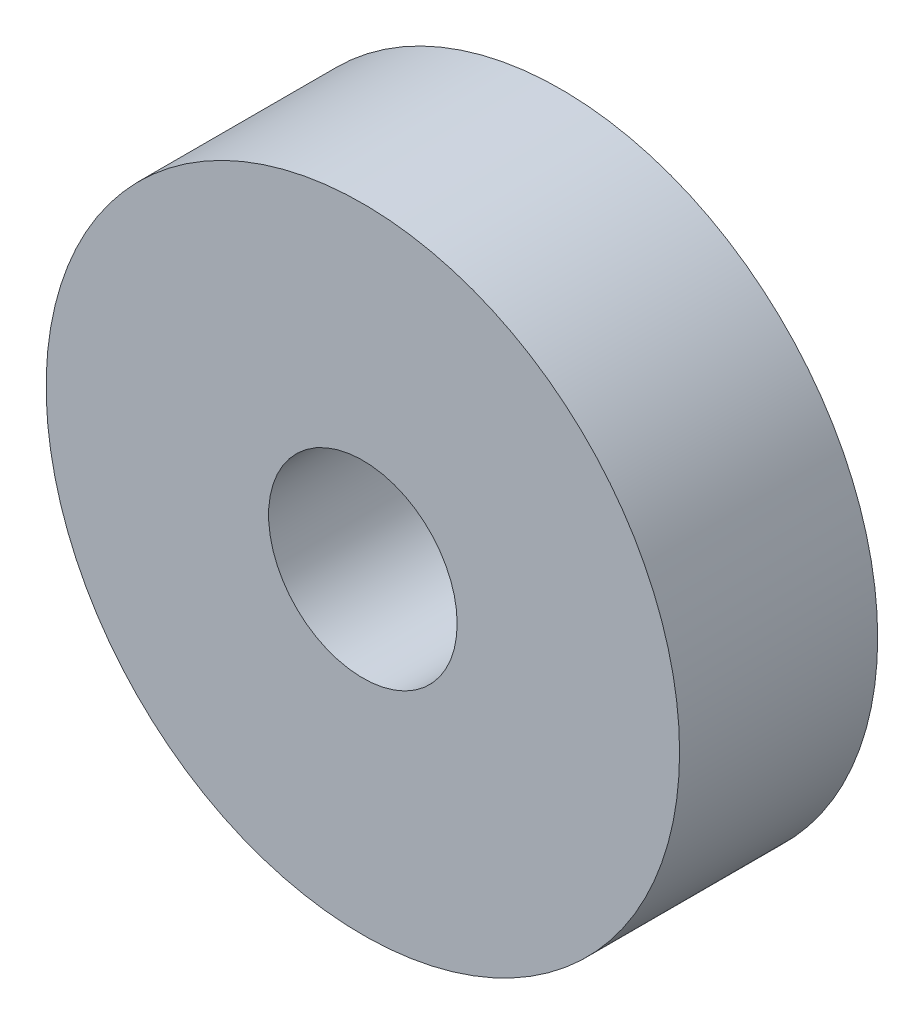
from build123d import *

# Parameters (mm, degrees)
SKETCH1_R           = 5
SKETCH1_R_2         = 1.5875
BOSS_EXTRUDE1_DEPTH = 3.175
MOVE_FACE1_BY       = 0.0762
MOVE_FACE1_2_BY     = 0.0762


with BuildPart() as part:
    # Sketch1 → Boss-Extrude1 (new body)
    with BuildSketch(Plane.XY):
        Circle(SKETCH1_R)
        Circle(SKETCH1_R_2, mode=Mode.SUBTRACT)
    extrude(amount=BOSS_EXTRUDE1_DEPTH)

    # Move Face1: a curved face moved outward by 0.0762
    add(Solid.thicken(part.faces().sort_by_distance((-1.5875, 0, 1.5875))[0], MOVE_FACE1_BY))

    # Move Face1 2: a curved face moved outward by 0.0762
    add(Solid.thicken(part.faces().sort_by_distance((-5, 0, 1.5875))[0], MOVE_FACE1_2_BY))


solid = part.part
